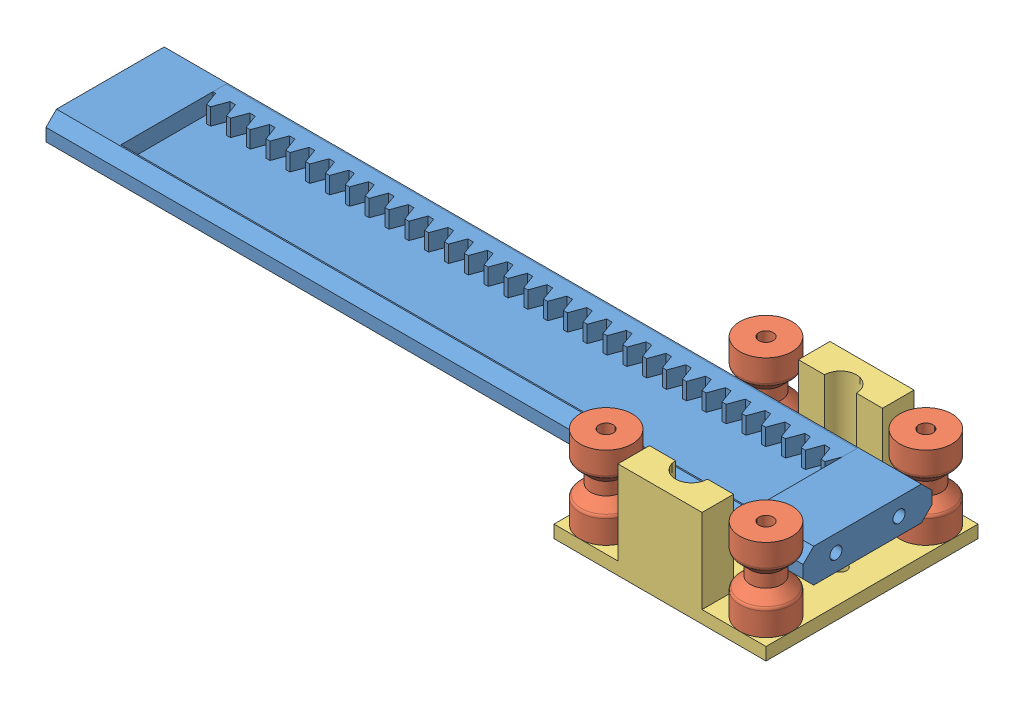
SolidWorks assembly 装配体1.sldasm, configuration 默认 (file format 11000). Lengths in mm.
Overall size (182.47 23 53.21).
6 component instances, 3 part files, 13 mates.
Components (placement in the parent):
- X轴滑轨-1: X轴滑轨.SLDPRT [默认] at (2.7727 -1.076 180) size (180 8 30.6)
- 滚轮-1: 滚轮.SLDPRT [默认] at (49.6391 -6.976 199) x (0.999995 0 -0.003042) z (0.003042 0 0.999995) size (12.4 19.6 12.4)
- 滚轮-2: 滚轮.SLDPRT [默认] at (49.6391 -6.976 161) x (-0.261529 0 -0.965196) z (0.965196 0 -0.261529) size (12.4 19.6 12.4)
- 滚轮-3: 滚轮.SLDPRT [默认] at (87.6391 -6.976 199) x (-0.261529 0 -0.965196) z (0.965196 0 -0.261529) size (12.4 19.6 12.4)
- 滚轮-4: 滚轮.SLDPRT [默认] at (87.6391 -6.976 161) x (-0.261529 0 -0.965196) z (0.965196 0 -0.261529) size (12.4 19.6 12.4)
- 电机支撑板-1: 电机支撑板.SLDPRT [默认] at (68.6391 -6.976 180) size (50.4 23 50.4)
Mates (geometry in assembly coordinates):
- 相切4: tangent: cylinder of X轴滑轨-1; cylinder of ? through (-7.3115 26.1044 161) axis (0 1 0) radius 3.7
- 平行1: parallel: plane of X轴滑轨-1 through (2.7727 -1.076 180) normal (0 -1 0); plane of ? through (-7.3115 -6.976 161) normal (0 -1 0)
- 相切5: tangent: cone of X轴滑轨-1; cylinder of ? through (-7.3115 -1.076 161) axis (0 1 0) radius 785.3982
- 平行2: parallel: plane of X轴滑轨-1 through (2.7727 -1.076 180) normal (0 -1 0); plane of ? through (-7.3115 -6.976 199) normal (0 -1 0)
- 相切9: tangent: plane of X轴滑轨-1 through (-87.2273 6.924 195.3) normal (0 0 1); cylinder of ? through (-7.3115 26.1044 199) axis (0 1 0) radius 3.7
- 相切10: tangent: plane of X轴滑轨-1 through (-87.2273 1.424 195.3) normal (0 -0.707107 0.707107); cylinder of ? through (-7.3115 -1.076 199) axis (0 1 0) radius 785.3982
- 同心1: concentric: cylinder of ? through (-7.3115 12.624 161) axis (0 -1 0) radius 1.7; cylinder of ? through (-7.3115 -9.976 161) axis (0 1 0) radius 1.4
- 同心2: concentric: cylinder of ? through (-7.3115 12.624 199) axis (0 -1 0) radius 1.7; cylinder of ? through (-7.3115 -9.976 199) axis (0 1 0) radius 1.4
- 重合3: coincident: plane of ? through (-7.3115 -6.976 199) normal (0 -1 0); plane of ? through (11.6885 -6.976 180) normal (0 1 0)
- 重合4: coincident: plane of ? through (30.6885 -6.976 199) normal (0 -1 0); plane of ? through (11.6885 -6.976 180) normal (0 1 0)
- 同心3: concentric: cylinder of ? through (30.6885 12.624 199) axis (0 -1 0) radius 1.7; cylinder of ? through (30.6885 -9.976 199) axis (0 1 0) radius 1.4
- 同心4: concentric: cylinder of ? through (30.6885 12.624 161) axis (0 -1 0) radius 1.7; cylinder of ? through (30.6885 -9.976 161) axis (0 1 0) radius 1.4
- 重合5: coincident: plane of ? through (30.6885 -6.976 161) normal (0 -1 0); plane of ? through (11.6885 -6.976 180) normal (0 1 0)
